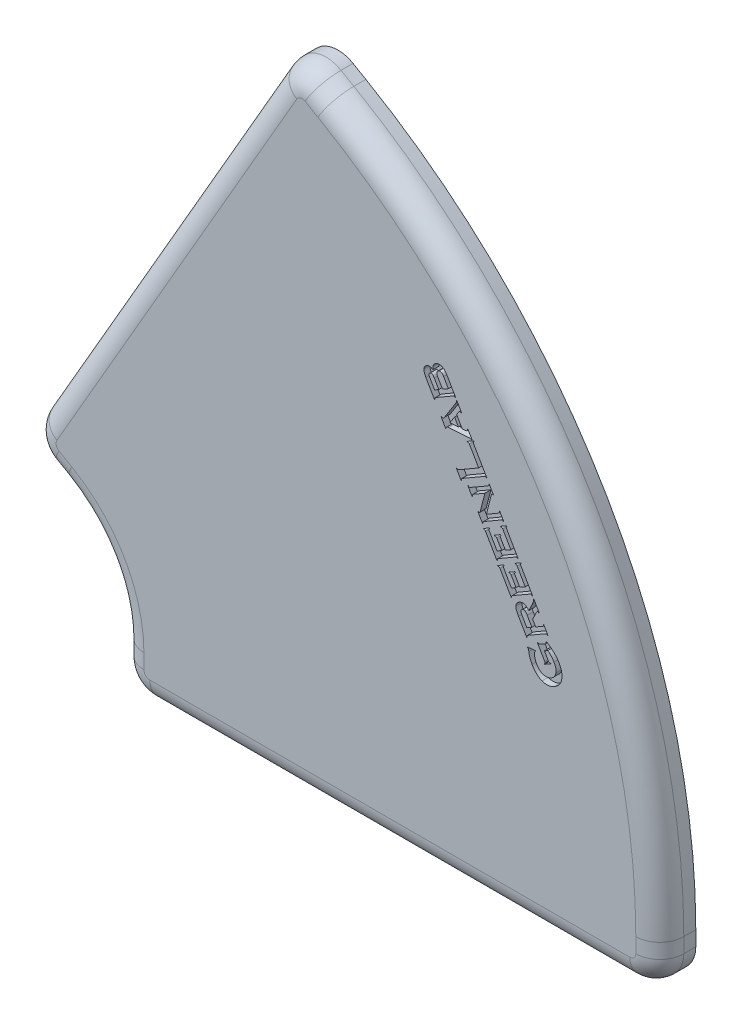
from build123d import *

# Parameters (mm, degrees)
BOSS_EXTRUDE1_DEPTH = 3
FILLET1_R           = 2.5
FILLET2_R           = 9.999999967
FILLET3_R           = 54.99999982
FILLET4_R           = 2
CUT_EXTRUDE1_DEPTH  = 0.5


with BuildPart() as part:
    # Sketch1 → Boss-Extrude1 (new body)
    with BuildSketch(Plane.XY.offset(3)):
        Polygon((22.499998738, -22.500000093), (22.499998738, 12.990320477), (-8.235571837, 30.735577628), (-30.735573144, -8.23557194), (-22.500001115, -12.990381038), (-22.500001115, -22.500000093), align=None)
    extrude(amount=-BOSS_EXTRUDE1_DEPTH)

    # Fillet1
    fillet1_edges = [part.edges().sort_by_distance(p)[0] for p in [
        (-22.500001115, -22.500000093, 1.5),
        (-30.735573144, -8.23557194, 1.5),
        (-8.235571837, 30.735577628, 1.5),
        (22.499998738, -22.500000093, 1.5),
    ]]
    fillet(fillet1_edges, radius=FILLET1_R)

    # Fillet2
    fillet2_edges = [part.edges().sort_by_distance(p)[0] for p in [
        (-22.500001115, -12.990381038, 1.5),
    ]]
    fillet(fillet2_edges, radius=FILLET2_R)

    # Fillet3
    fillet3_edges = [part.edges().sort_by_distance(p)[0] for p in [
        (22.499998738, 12.990320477, 1.5),
    ]]
    fillet(fillet3_edges, radius=FILLET3_R)

    # Fillet4
    fillet4_edges = [part.edges().sort_by_distance(p)[0] for p in [
        (-1.189e-06, -22.500000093, 3),
        (22.499998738, -19.381942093, 3),
        (-19.485573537, 11.250001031, 3),
        (-28.035255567, -9.794600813, 3),
        (-21.767768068, -21.767767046, 3),
        (21.767765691, -21.767767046, 3),
        (-29.735324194, -7.967555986, 3),
        (-7.967555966, 29.735325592, 3),
        (-22.500001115, -19.381942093, 3),
        (-23.839747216, -13.763883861, 3),
        (-5.535214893, 29.176519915, 3),
        (15.131418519, 8.73607676, 3),
    ]]
    fillet(fillet4_edges, radius=FILLET4_R)

    # Sketch2 → Cut-Extrude1 (cut)
    # profile 1 of 8: a face of its own
    with BuildSketch(Plane.XY.offset(3)):
        with BuildLine():
            add(Edge.make_bspline(
                [(3.589618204, 13.705303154), (3.587638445, 13.731512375), (3.583900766, 13.780993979), (3.583940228, 13.851126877), (3.587916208, 13.912828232), (3.595742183, 13.950404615), (3.599383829, 13.967889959)],
                knots=[0, 0, 0, 0, 1.194992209, 2.256081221, 3.188505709, 4, 4, 4, 4], degree=3))
            add(Edge.make_bspline(
                [(3.599383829, 13.967889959), (3.603108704, 13.983759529), (3.61049232, 14.015216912), (3.629176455, 14.059817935), (3.651168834, 14.102459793), (3.678578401, 14.142300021), (3.710805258, 14.179212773), (3.747630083, 14.213814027), (3.789298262, 14.24575152), (3.819833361, 14.264387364), (3.835386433, 14.273879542)],
                knots=[0, 0, 0, 0, 0.979892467, 1.942387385, 2.901921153, 3.865401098, 4.845716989, 5.84715339, 6.903446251, 8, 8, 8, 8], degree=3))
            add(Edge.make_bspline(
                [(3.835386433, 14.273879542), (3.856859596, 14.28555997), (3.898821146, 14.308385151), (3.964328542, 14.334048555), (4.02993179, 14.351049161), (4.095325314, 14.359788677), (4.16045815, 14.360627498), (4.22526618, 14.351954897), (4.290099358, 14.336029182), (4.331810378, 14.318911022), (4.352964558, 14.310229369)],
                knots=[0, 0, 0, 0, 1.084995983, 2.120233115, 3.115816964, 4.0882861, 5.044225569, 5.999726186, 6.985540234, 8, 8, 8, 8], degree=3))
            add(Edge.make_bspline(
                [(4.352964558, 14.310229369), (4.3718211, 14.301052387), (4.410092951, 14.282426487), (4.464220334, 14.246277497), (4.517714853, 14.205358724), (4.568712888, 14.156843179), (4.618794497, 14.102797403), (4.666364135, 14.041371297), (4.713147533, 13.974321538), (4.741888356, 13.926299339), (4.756610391, 13.901700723)],
                knots=[0, 0, 0, 0, 0.861570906, 1.748672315, 2.671085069, 3.628806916, 4.639478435, 5.698894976, 6.821295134, 8, 8, 8, 8], degree=3))
            Line((4.756610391, 13.901700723), (5.487947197, 12.635424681))
            Line((5.487947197, 12.635424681), (5.453224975, 12.615350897))
            add(Edge.make_bspline(
                [(5.453224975, 12.615350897), (5.445585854, 12.622731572), (5.431260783, 12.636572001), (5.409017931, 12.653904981), (5.386958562, 12.665578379), (5.365433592, 12.672537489), (5.343578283, 12.674072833), (5.321215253, 12.671392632), (5.297910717, 12.663229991), (5.282768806, 12.655344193), (5.274731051, 12.651158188)],
                knots=[0, 0, 0, 0, 1.270161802, 2.381839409, 3.358928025, 4.241437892, 5.065851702, 5.959161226, 6.916664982, 8, 8, 8, 8], degree=3))
            Line((5.274731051, 12.651158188), (3.809887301, 11.805346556))
            add(Edge.make_bspline(
                [(3.809887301, 11.805346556), (3.802365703, 11.80044521), (3.788188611, 11.791206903), (3.769578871, 11.775550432), (3.756395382, 11.757781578), (3.747075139, 11.738691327), (3.74302046, 11.716916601), (3.742029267, 11.692092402), (3.744910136, 11.663467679), (3.749434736, 11.643446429), (3.751836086, 11.632820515)],
                knots=[0, 0, 0, 0, 1.077921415, 2.03172136, 2.900158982, 3.715982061, 4.559082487, 5.537039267, 6.692828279, 8, 8, 8, 8], degree=3))
            Line((3.751836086, 11.632820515), (3.717113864, 11.61274673))
            Line((3.717113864, 11.61274673), (3.002595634, 12.850268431))
            add(Edge.make_bspline(
                [(3.002595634, 12.850268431), (2.987869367, 12.876716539), (2.959447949, 12.927760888), (2.922364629, 13.004111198), (2.891590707, 13.076893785), (2.868981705, 13.14694328), (2.851454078, 13.213109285), (2.841891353, 13.276190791), (2.837699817, 13.336068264), (2.841321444, 13.374549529), (2.843090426, 13.393345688)],
                knots=[0, 0, 0, 0, 1.262450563, 2.43650574, 3.53900008, 4.55520189, 5.504738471, 6.390241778, 7.213714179, 8, 8, 8, 8], degree=3))
            add(Edge.make_bspline(
                [(2.843090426, 13.393345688), (2.846100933, 13.412242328), (2.851994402, 13.449235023), (2.8679608, 13.502484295), (2.889856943, 13.552103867), (2.917132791, 13.598688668), (2.950369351, 13.641850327), (2.98998413, 13.680877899), (3.034663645, 13.71724658), (3.067983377, 13.737686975), (3.085060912, 13.748163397)],
                knots=[0, 0, 0, 0, 1.028227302, 2.01289216, 2.979670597, 3.938786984, 4.909519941, 5.899836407, 6.923592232, 8, 8, 8, 8], degree=3))
            add(Edge.make_bspline(
                [(3.085060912, 13.748163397), (3.105408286, 13.759062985), (3.144334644, 13.779914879), (3.205078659, 13.800740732), (3.264103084, 13.812378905), (3.323186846, 13.81225867), (3.383760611, 13.800856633), (3.448577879, 13.780026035), (3.518154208, 13.74719828), (3.564882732, 13.719804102), (3.589618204, 13.705303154)],
                knots=[0, 0, 0, 0, 1.027134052, 1.964999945, 2.850141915, 3.69630986, 4.580019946, 5.586717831, 6.722543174, 8, 8, 8, 8], degree=3))
        make_face()
        with BuildLine():
            Line((4.07627185, 12.514439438), (3.698125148, 13.168736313))
            add(Edge.make_bspline(
                [(3.698125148, 13.168736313), (3.683802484, 13.192266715), (3.657312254, 13.235786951), (3.616096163, 13.293056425), (3.575360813, 13.335680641), (3.535370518, 13.365597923), (3.493584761, 13.381079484), (3.45005292, 13.38478442), (3.404640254, 13.373701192), (3.375943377, 13.359258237), (3.360668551, 13.351570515)],
                knots=[0, 0, 0, 0, 1.504565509, 2.782742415, 3.844473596, 4.71599428, 5.484793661, 6.247669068, 7.067266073, 8, 8, 8, 8], degree=3))
            add(Edge.make_bspline(
                [(3.360668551, 13.351570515), (3.346493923, 13.342374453), (3.319729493, 13.325010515), (3.287885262, 13.291305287), (3.268605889, 13.25234453), (3.261441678, 13.208672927), (3.266973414, 13.159372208), (3.284589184, 13.103108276), (3.312556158, 13.037930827), (3.337435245, 12.992911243), (3.350902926, 12.968541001)],
                knots=[0, 0, 0, 0, 0.921957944, 1.740834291, 2.501514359, 3.26399212, 4.127962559, 5.188851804, 6.478254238, 8, 8, 8, 8], degree=3))
            Line((3.350902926, 12.968541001), (3.729049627, 12.314244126))
            Line((3.729049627, 12.314244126), (4.07627185, 12.514439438))
        make_face(mode=Mode.SUBTRACT)
        with BuildLine():
            Line((4.874882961, 12.975593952), (4.483172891, 13.653762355))
            add(Edge.make_bspline(
                [(4.483172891, 13.653762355), (4.467687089, 13.679133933), (4.43860537, 13.726780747), (4.388465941, 13.787824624), (4.336708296, 13.834691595), (4.282465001, 13.867089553), (4.225719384, 13.884089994), (4.167100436, 13.885518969), (4.107078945, 13.872124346), (4.069749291, 13.852713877), (4.050230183, 13.842564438)],
                knots=[0, 0, 0, 0, 1.32586928, 2.489929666, 3.513828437, 4.429211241, 5.287664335, 6.127732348, 7.021019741, 8, 8, 8, 8], degree=3))
            add(Edge.make_bspline(
                [(4.050230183, 13.842564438), (4.031489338, 13.830730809), (3.995904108, 13.808261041), (3.95454941, 13.762677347), (3.926005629, 13.711558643), (3.913332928, 13.653719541), (3.91375172, 13.590679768), (3.928315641, 13.522318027), (3.956122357, 13.44831521), (3.982832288, 13.399355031), (3.99706178, 13.373271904)],
                knots=[0, 0, 0, 0, 0.985570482, 1.871407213, 2.716839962, 3.570750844, 4.483125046, 5.512375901, 6.674739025, 8, 8, 8, 8], degree=3))
            Line((3.99706178, 13.373271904), (4.38877185, 12.695103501))
            Line((4.38877185, 12.695103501), (4.874882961, 12.975593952))
        make_face(mode=Mode.SUBTRACT)
    # profile 2 of 8: a face of its own
    with BuildSketch(Plane.XY.offset(3)):
        with BuildLine():
            Line((5.567157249, 11.455454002), (6.028854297, 10.655757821))
            Line((6.028854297, 10.655757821), (6.286015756, 10.676916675))
            add(Edge.make_bspline(
                [(6.286015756, 10.676916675), (6.300343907, 10.678467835), (6.326987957, 10.681352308), (6.363393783, 10.689064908), (6.393817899, 10.697782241), (6.411065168, 10.706179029), (6.418936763, 10.710011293)],
                knots=[0, 0, 0, 0, 1.254135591, 2.332139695, 3.238794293, 4, 4, 4, 4], degree=3))
            add(Edge.make_bspline(
                [(6.418936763, 10.710011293), (6.425034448, 10.713989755), (6.4368143, 10.721675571), (6.451932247, 10.73589384), (6.462935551, 10.75270111), (6.470708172, 10.771262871), (6.474312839, 10.7919527), (6.474910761, 10.814286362), (6.47132581, 10.838526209), (6.466862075, 10.854912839), (6.464509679, 10.86354862)],
                knots=[0, 0, 0, 0, 0.996004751, 1.924137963, 2.816916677, 3.727375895, 4.659793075, 5.675305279, 6.774882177, 8, 8, 8, 8], degree=3))
            Line((6.464509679, 10.86354862), (6.499231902, 10.883622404))
            Line((6.499231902, 10.883622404), (6.870325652, 10.241261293))
            Line((6.870325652, 10.241261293), (6.835603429, 10.221187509))
            add(Edge.make_bspline(
                [(6.835603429, 10.221187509), (6.82840569, 10.229716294), (6.814834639, 10.24579698), (6.792238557, 10.265487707), (6.770065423, 10.280733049), (6.746147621, 10.290415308), (6.718900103, 10.296564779), (6.685747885, 10.299324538), (6.645326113, 10.299758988), (6.616052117, 10.298063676), (6.60014336, 10.29714237)],
                knots=[0, 0, 0, 0, 1.0241798, 1.931050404, 2.747002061, 3.484717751, 4.287012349, 5.305783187, 6.535845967, 8, 8, 8, 8], degree=3))
            Line((6.60014336, 10.29714237), (4.90092461, 10.181039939))
            add(Edge.make_bspline(
                [(4.90092461, 10.181039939), (4.885680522, 10.179769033), (4.856598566, 10.177344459), (4.816016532, 10.168346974), (4.779871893, 10.157409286), (4.758656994, 10.146616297), (4.748472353, 10.141434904)],
                knots=[0, 0, 0, 0, 1.155103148, 2.203651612, 3.137626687, 4, 4, 4, 4], degree=3))
            add(Edge.make_bspline(
                [(4.748472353, 10.141434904), (4.738508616, 10.134332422), (4.718519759, 10.120083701), (4.701079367, 10.084741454), (4.692968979, 10.042120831), (4.695883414, 10.01125456), (4.697474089, 9.994407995)],
                knots=[0, 0, 0, 0, 0.876646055, 1.75869295, 2.776712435, 4, 4, 4, 4], degree=3))
            Line((4.697474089, 9.994407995), (4.662751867, 9.97433421))
            Line((4.662751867, 9.97433421), (4.263988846, 10.664980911))
            Line((4.263988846, 10.664980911), (4.298711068, 10.685054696))
            add(Edge.make_bspline(
                [(4.298711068, 10.685054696), (4.312398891, 10.675456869), (4.337646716, 10.65775323), (4.379674, 10.643247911), (4.421279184, 10.64394328), (4.44544781, 10.655031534), (4.457673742, 10.660640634)],
                knots=[0, 0, 0, 0, 1.167210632, 2.152974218, 3.065664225, 4, 4, 4, 4], degree=3))
            add(Edge.make_bspline(
                [(4.457673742, 10.660640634), (4.466724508, 10.666729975), (4.485877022, 10.679615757), (4.512565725, 10.705508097), (4.53966993, 10.737343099), (4.555962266, 10.762074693), (4.564553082, 10.77511546)],
                knots=[0, 0, 0, 0, 0.827633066, 1.751371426, 2.814316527, 4, 4, 4, 4], degree=3))
            Line((4.564553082, 10.77511546), (5.459735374, 12.190046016))
            add(Edge.make_bspline(
                [(5.459735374, 12.190046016), (5.470725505, 12.208047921), (5.490741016, 12.240833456), (5.51603996, 12.286475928), (5.533780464, 12.323706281), (5.544862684, 12.354718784), (5.549846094, 12.383209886), (5.547986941, 12.412697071), (5.542769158, 12.444838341), (5.535647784, 12.466636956), (5.531892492, 12.478131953)],
                knots=[0, 0, 0, 0, 1.626172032, 2.96162641, 4.022219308, 4.802727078, 5.495044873, 6.234619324, 7.069067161, 8, 8, 8, 8], degree=3))
            Line((5.531892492, 12.478131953), (5.566614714, 12.498205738))
            Line((5.566614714, 12.498205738), (5.997929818, 11.75167796))
            Line((5.997929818, 11.75167796), (5.963207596, 11.731604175))
            add(Edge.make_bspline(
                [(5.963207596, 11.731604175), (5.956638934, 11.738944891), (5.944263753, 11.752774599), (5.924777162, 11.770851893), (5.904248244, 11.783240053), (5.884044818, 11.792566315), (5.863144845, 11.796504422), (5.842352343, 11.79496065), (5.821273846, 11.79042835), (5.808272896, 11.7834881), (5.801532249, 11.779889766)],
                knots=[0, 0, 0, 0, 1.269668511, 2.392020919, 3.407178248, 4.346494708, 5.246852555, 6.110269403, 7.02022494, 8, 8, 8, 8], degree=3))
            add(Edge.make_bspline(
                [(5.801532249, 11.779889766), (5.792827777, 11.774181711), (5.774046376, 11.761865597), (5.74845116, 11.736232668), (5.722143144, 11.704431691), (5.705990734, 11.68005783), (5.697365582, 11.667042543)],
                knots=[0, 0, 0, 0, 0.804698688, 1.736276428, 2.791204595, 4, 4, 4, 4], degree=3))
            Line((5.697365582, 11.667042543), (5.567157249, 11.455454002))
        make_face()
        Polygon((5.395173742, 11.191782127), (4.995325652, 10.578717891), (5.717981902, 10.632971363), align=None, mode=Mode.SUBTRACT)
    # profile 3 of 8: a face of its own
    with BuildSketch(Plane.XY.offset(3)):
        with BuildLine():
            Line((7.401467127, 8.519067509), (6.626727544, 9.860755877))
            add(Edge.make_bspline(
                [(6.626727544, 9.860755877), (6.621826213, 9.868277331), (6.612587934, 9.882454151), (6.596931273, 9.901065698), (6.57916305, 9.9142432), (6.560070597, 9.923584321), (6.538304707, 9.927555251), (6.513578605, 9.928926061), (6.485244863, 9.924280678), (6.465377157, 9.919655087), (6.454744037, 9.917179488)],
                knots=[0, 0, 0, 0, 1.079559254, 2.034808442, 2.904565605, 3.721628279, 4.566009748, 5.545452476, 6.686335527, 8, 8, 8, 8], degree=3))
            Line((6.454744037, 9.917179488), (6.434670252, 9.951901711))
            Line((6.434670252, 9.951901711), (6.990225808, 10.273082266))
            Line((6.990225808, 10.273082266), (7.010299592, 10.238360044))
            add(Edge.make_bspline(
                [(7.010299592, 10.238360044), (7.002913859, 10.230352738), (6.989124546, 10.215402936), (6.971969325, 10.19245979), (6.959686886, 10.170894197), (6.952527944, 10.149875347), (6.951014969, 10.128882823), (6.953864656, 10.107097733), (6.961868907, 10.084129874), (6.969760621, 10.068988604), (6.973949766, 10.06095119)],
                knots=[0, 0, 0, 0, 1.309722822, 2.445279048, 3.438336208, 4.284481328, 5.091995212, 5.947318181, 6.910378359, 8, 8, 8, 8], degree=3))
            Line((6.973949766, 10.06095119), (8.089401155, 8.129527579))
            Line((8.089401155, 8.129527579), (8.054678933, 8.109453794))
            add(Edge.make_bspline(
                [(8.054678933, 8.109453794), (8.046688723, 8.117031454), (8.031846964, 8.131106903), (8.008934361, 8.148444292), (7.987066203, 8.159976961), (7.96621301, 8.167243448), (7.945184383, 8.168769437), (7.923527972, 8.165735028), (7.900462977, 8.158704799), (7.885639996, 8.150616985), (7.877812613, 8.146346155)],
                knots=[0, 0, 0, 0, 1.327910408, 2.466584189, 3.452040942, 4.300509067, 5.110239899, 5.96791107, 6.926940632, 8, 8, 8, 8], degree=3))
            Line((7.877812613, 8.146346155), (6.02776921, 7.077552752))
            add(Edge.make_bspline(
                [(6.02776921, 7.077552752), (6.020227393, 7.072863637), (6.005936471, 7.063978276), (5.987459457, 7.048288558), (5.974422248, 7.030633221), (5.964914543, 7.011860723), (5.960596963, 6.990208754), (5.961492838, 6.965374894), (5.963614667, 6.936697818), (5.968662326, 6.916727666), (5.971345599, 6.90611178)],
                knots=[0, 0, 0, 0, 1.069591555, 2.026759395, 2.898263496, 3.697307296, 4.543384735, 5.523826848, 6.683696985, 8, 8, 8, 8], degree=3))
            Line((5.971345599, 6.90611178), (5.936623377, 6.886037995))
            Line((5.936623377, 6.886037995), (5.535690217, 7.58048244))
            Line((5.535690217, 7.58048244), (5.570412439, 7.600556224))
            add(Edge.make_bspline(
                [(5.570412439, 7.600556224), (5.578216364, 7.592970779), (5.59268997, 7.578902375), (5.61531589, 7.561560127), (5.636803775, 7.549397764), (5.657974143, 7.542227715), (5.679409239, 7.54053598), (5.701339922, 7.54440562), (5.724636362, 7.551249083), (5.739454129, 7.559373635), (5.747278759, 7.563663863)],
                knots=[0, 0, 0, 0, 1.308080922, 2.426042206, 3.418950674, 4.264969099, 5.094042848, 5.973778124, 6.930038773, 8, 8, 8, 8], degree=3))
            Line((5.747278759, 7.563663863), (7.401467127, 8.519067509))
        make_face()
    # profile 4 of 8: a face of its own
    with BuildSketch(Plane.XY.offset(3)):
        with BuildLine():
            Line((8.047625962, 5.499292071), (9.063250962, 6.085772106))
            add(Edge.make_bspline(
                [(9.063250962, 6.085772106), (9.070772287, 6.090673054), (9.085162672, 6.10004993), (9.103947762, 6.115914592), (9.117369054, 6.134109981), (9.1272172, 6.153624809), (9.131803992, 6.175967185), (9.132719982, 6.201020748), (9.129858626, 6.229281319), (9.125333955, 6.248938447), (9.122929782, 6.259383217)],
                knots=[0, 0, 0, 0, 1.069398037, 2.046055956, 2.907626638, 3.745722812, 4.628832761, 5.599056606, 6.724264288, 8, 8, 8, 8], degree=3))
            Line((9.122929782, 6.259383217), (9.157652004, 6.279457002))
            Line((9.157652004, 6.279457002), (9.49836381, 5.689179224))
            Line((9.49836381, 5.689179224), (9.463641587, 5.669105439))
            add(Edge.make_bspline(
                [(9.463641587, 5.669105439), (9.456002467, 5.676486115), (9.441677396, 5.690326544), (9.419434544, 5.707659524), (9.397375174, 5.719332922), (9.375850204, 5.726292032), (9.353994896, 5.727827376), (9.331631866, 5.725147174), (9.30832733, 5.716984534), (9.293185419, 5.709098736), (9.285147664, 5.704912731)],
                knots=[0, 0, 0, 0, 1.270161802, 2.381839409, 3.358928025, 4.241437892, 5.065851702, 5.959161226, 6.916664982, 8, 8, 8, 8], degree=3))
            Line((9.285147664, 5.704912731), (7.820303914, 4.859101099))
            add(Edge.make_bspline(
                [(7.820303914, 4.859101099), (7.812782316, 4.854199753), (7.798605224, 4.844961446), (7.779995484, 4.829304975), (7.766811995, 4.811536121), (7.757491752, 4.79244587), (7.753437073, 4.770671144), (7.75244588, 4.745846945), (7.755326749, 4.717222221), (7.759851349, 4.697200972), (7.762252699, 4.686575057)],
                knots=[0, 0, 0, 0, 1.077921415, 2.03172136, 2.900158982, 3.715982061, 4.559082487, 5.537039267, 6.692828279, 8, 8, 8, 8], degree=3))
            Line((7.762252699, 4.686575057), (7.727530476, 4.666501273))
            Line((7.727530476, 4.666501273), (7.333650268, 5.349009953))
            Line((7.333650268, 5.349009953), (7.36837249, 5.369083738))
            add(Edge.make_bspline(
                [(7.36837249, 5.369083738), (7.377381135, 5.360248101), (7.393412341, 5.344524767), (7.420628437, 5.329650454), (7.44776587, 5.324845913), (7.463262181, 5.331579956), (7.470911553, 5.33490405)],
                knots=[0, 0, 0, 0, 1.290703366, 2.296853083, 3.159283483, 4, 4, 4, 4], degree=3))
            add(Edge.make_bspline(
                [(7.470911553, 5.33490405), (7.477406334, 5.339442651), (7.491413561, 5.349231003), (7.506466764, 5.373161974), (7.520911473, 5.402639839), (7.527532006, 5.425533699), (7.531132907, 5.437985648)],
                knots=[0, 0, 0, 0, 0.771714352, 1.664348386, 2.729641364, 4, 4, 4, 4], degree=3))
            Line((7.531132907, 5.437985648), (7.925013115, 6.956540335))
            Line((7.925013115, 6.956540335), (6.938142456, 6.386878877))
            add(Edge.make_bspline(
                [(6.938142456, 6.386878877), (6.930609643, 6.381986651), (6.916411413, 6.372765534), (6.897858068, 6.356923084), (6.884115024, 6.339360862), (6.874327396, 6.320277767), (6.869306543, 6.298355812), (6.869335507, 6.273385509), (6.872680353, 6.244810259), (6.877505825, 6.22497843), (6.88009124, 6.214352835)],
                knots=[0, 0, 0, 0, 1.073417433, 2.023232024, 2.901183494, 3.723036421, 4.567333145, 5.562098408, 6.693809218, 8, 8, 8, 8], degree=3))
            Line((6.88009124, 6.214352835), (6.845369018, 6.19427905))
            Line((6.845369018, 6.19427905), (6.504114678, 6.784556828))
            Line((6.504114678, 6.784556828), (6.5388369, 6.804630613))
            add(Edge.make_bspline(
                [(6.5388369, 6.804630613), (6.546826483, 6.797050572), (6.561667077, 6.782970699), (6.584587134, 6.765661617), (6.606585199, 6.753961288), (6.627862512, 6.746887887), (6.649447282, 6.745179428), (6.671497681, 6.748879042), (6.6945769, 6.756575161), (6.709484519, 6.764599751), (6.717330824, 6.768823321)],
                knots=[0, 0, 0, 0, 1.315771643, 2.444036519, 3.420484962, 4.281782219, 5.105655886, 5.979873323, 6.936749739, 8, 8, 8, 8], degree=3))
            Line((6.717330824, 6.768823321), (8.180546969, 7.613549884))
            add(Edge.make_bspline(
                [(8.180546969, 7.613549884), (8.188031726, 7.618491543), (8.202253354, 7.627881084), (8.221423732, 7.643133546), (8.234481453, 7.661272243), (8.244539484, 7.680272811), (8.249168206, 7.702475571), (8.250018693, 7.727535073), (8.247068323, 7.75631615), (8.242623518, 7.776352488), (8.240225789, 7.787160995)],
                knots=[0, 0, 0, 0, 1.0681569, 2.029582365, 2.890153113, 3.707978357, 4.569086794, 5.559678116, 6.683579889, 8, 8, 8, 8], degree=3))
            Line((8.240225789, 7.787160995), (8.274948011, 7.80723478))
            Line((8.274948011, 7.80723478), (8.642786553, 7.170299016))
            Line((8.642786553, 7.170299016), (8.608064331, 7.150225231))
            add(Edge.make_bspline(
                [(8.608064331, 7.150225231), (8.599574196, 7.159128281), (8.584414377, 7.175025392), (8.558696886, 7.191572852), (8.531978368, 7.195895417), (8.516793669, 7.189648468), (8.509323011, 7.186575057)],
                knots=[0, 0, 0, 0, 1.289593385, 2.30267275, 3.164938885, 4, 4, 4, 4], degree=3))
            add(Edge.make_bspline(
                [(8.509323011, 7.186575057), (8.502113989, 7.181046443), (8.48631733, 7.168931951), (8.474798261, 7.143455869), (8.465381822, 7.116389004), (8.455462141, 7.085854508), (8.444566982, 7.04565364), (8.435950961, 7.015844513), (8.431198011, 6.999400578)],
                knots=[0, 0, 0, 0, 0.781868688, 1.713257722, 2.366731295, 3.294374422, 4.507466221, 6, 6, 6, 6], degree=3))
            Line((8.431198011, 6.999400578), (8.047625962, 5.499292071))
        make_face()
    # profile 5 of 8: a face of its own
    with BuildSketch(Plane.XY.offset(3)):
        with BuildLine():
            Line((9.631827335, 3.694079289), (10.083216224, 3.954495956))
            Line((10.083216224, 3.954495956), (9.411015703, 5.118232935))
            add(Edge.make_bspline(
                [(9.411015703, 5.118232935), (9.406156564, 5.12597128), (9.396932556, 5.140660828), (9.380484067, 5.159569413), (9.362658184, 5.173780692), (9.343326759, 5.183701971), (9.321394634, 5.188569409), (9.296485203, 5.189282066), (9.267648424, 5.186502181), (9.247660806, 5.181629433), (9.236862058, 5.178996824)],
                knots=[0, 0, 0, 0, 1.078086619, 2.04651052, 2.943787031, 3.755659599, 4.589703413, 5.573084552, 6.68880582, 8, 8, 8, 8], degree=3))
            Line((9.236862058, 5.178996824), (9.216788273, 5.213719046))
            Line((9.216788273, 5.213719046), (9.737621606, 5.514825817))
            Line((9.737621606, 5.514825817), (9.757695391, 5.480103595))
            add(Edge.make_bspline(
                [(9.757695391, 5.480103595), (9.750210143, 5.472536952), (9.736146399, 5.458320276), (9.72002887, 5.435082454), (9.707301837, 5.413476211), (9.70055647, 5.391580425), (9.698747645, 5.369679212), (9.702560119, 5.347281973), (9.710156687, 5.323830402), (9.718202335, 5.308553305), (9.722430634, 5.300524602)],
                knots=[0, 0, 0, 0, 1.264087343, 2.375045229, 3.357651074, 4.2359404, 5.07787082, 5.948477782, 6.921845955, 8, 8, 8, 8], degree=3))
            Line((9.722430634, 5.300524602), (10.69628046, 3.614326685))
            Line((10.69628046, 3.614326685), (10.661558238, 3.5942529))
            add(Edge.make_bspline(
                [(10.661558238, 3.5942529), (10.653919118, 3.601633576), (10.639594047, 3.615474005), (10.617351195, 3.632806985), (10.595291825, 3.644480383), (10.573766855, 3.651439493), (10.551911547, 3.652974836), (10.529548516, 3.650294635), (10.50624398, 3.642131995), (10.49110207, 3.634246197), (10.483064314, 3.630060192)],
                knots=[0, 0, 0, 0, 1.270161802, 2.381839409, 3.358928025, 4.241437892, 5.065851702, 5.959161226, 6.916664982, 8, 8, 8, 8], degree=3))
            Line((10.483064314, 3.630060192), (9.018220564, 2.78424856))
            add(Edge.make_bspline(
                [(9.018220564, 2.78424856), (9.010698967, 2.779347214), (8.996521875, 2.770108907), (8.977912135, 2.754452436), (8.964728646, 2.736683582), (8.955408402, 2.717593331), (8.951353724, 2.695818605), (8.95036253, 2.670994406), (8.953243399, 2.642369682), (8.957768, 2.622348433), (8.960169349, 2.611722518)],
                knots=[0, 0, 0, 0, 1.077921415, 2.03172136, 2.900158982, 3.715982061, 4.559082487, 5.537039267, 6.692828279, 8, 8, 8, 8], degree=3))
            Line((8.960169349, 2.611722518), (8.925447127, 2.591648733))
            Line((8.925447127, 2.591648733), (7.973298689, 4.240411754))
            add(Edge.make_bspline(
                [(7.973298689, 4.240411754), (7.968546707, 4.248598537), (7.959602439, 4.264007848), (7.942197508, 4.282424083), (7.924826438, 4.297395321), (7.905000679, 4.306923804), (7.882960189, 4.311732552), (7.857825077, 4.312716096), (7.829294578, 4.308992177), (7.809237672, 4.304593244), (7.798602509, 4.302260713)],
                knots=[0, 0, 0, 0, 1.106938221, 2.083499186, 2.958610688, 3.784462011, 4.63397532, 5.590023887, 6.722111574, 8, 8, 8, 8], degree=3))
            Line((7.798602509, 4.302260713), (7.778528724, 4.336982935))
            Line((7.778528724, 4.336982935), (8.299362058, 4.637547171))
            Line((8.299362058, 4.637547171), (8.319435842, 4.602824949))
            add(Edge.make_bspline(
                [(8.319435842, 4.602824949), (8.311773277, 4.594705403), (8.297590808, 4.579677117), (8.281209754, 4.555633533), (8.268615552, 4.53384292), (8.262256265, 4.512087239), (8.261075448, 4.490345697), (8.265524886, 4.467666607), (8.273441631, 4.443162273), (8.282246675, 4.427273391), (8.286883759, 4.418905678)],
                knots=[0, 0, 0, 0, 1.297281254, 2.401108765, 3.380695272, 4.213553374, 5.01467439, 5.89033718, 6.888968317, 8, 8, 8, 8], degree=3))
            Line((8.286883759, 4.418905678), (8.937382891, 3.293146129))
            Line((8.937382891, 3.293146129), (9.319327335, 3.513415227))
            Line((9.319327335, 3.513415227), (8.910798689, 4.220880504))
            add(Edge.make_bspline(
                [(8.910798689, 4.220880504), (8.905783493, 4.228996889), (8.896318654, 4.24431439), (8.879370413, 4.263682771), (8.861129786, 4.278147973), (8.841520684, 4.288509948), (8.819235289, 4.293917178), (8.793951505, 4.295246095), (8.764977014, 4.292927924), (8.744744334, 4.288756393), (8.73393237, 4.286527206)],
                knots=[0, 0, 0, 0, 1.105542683, 2.086415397, 2.967788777, 3.793471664, 4.638126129, 5.605216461, 6.720272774, 8, 8, 8, 8], degree=3))
            Line((8.73393237, 4.286527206), (8.713858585, 4.321249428))
            Line((8.713858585, 4.321249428), (9.234691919, 4.622356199))
            Line((9.234691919, 4.622356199), (9.254765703, 4.587633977))
            add(Edge.make_bspline(
                [(9.254765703, 4.587633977), (9.247287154, 4.579696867), (9.233193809, 4.564739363), (9.217044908, 4.540699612), (9.205172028, 4.51826921), (9.197950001, 4.49644923), (9.197006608, 4.474059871), (9.201302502, 4.451022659), (9.209365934, 4.426090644), (9.218454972, 4.410078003), (9.223298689, 4.401544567)],
                knots=[0, 0, 0, 0, 1.255913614, 2.366772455, 3.327673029, 4.178836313, 4.993429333, 5.88161685, 6.871074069, 8, 8, 8, 8], degree=3))
            Line((9.223298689, 4.401544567), (9.631827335, 3.694079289))
        make_face()
    # profile 6 of 8: a face of its own
    with BuildSketch(Plane.XY.offset(3)):
        with BuildLine():
            Line((10.829743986, 1.61922675), (11.281132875, 1.879643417))
            Line((11.281132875, 1.879643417), (10.608932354, 3.043380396))
            add(Edge.make_bspline(
                [(10.608932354, 3.043380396), (10.604073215, 3.051118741), (10.594849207, 3.065808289), (10.578400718, 3.084716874), (10.560574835, 3.098928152), (10.54124341, 3.108849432), (10.519311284, 3.11371687), (10.494401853, 3.114429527), (10.465565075, 3.111649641), (10.445577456, 3.106776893), (10.434778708, 3.104144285)],
                knots=[0, 0, 0, 0, 1.078086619, 2.04651052, 2.943787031, 3.755659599, 4.589703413, 5.573084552, 6.68880582, 8, 8, 8, 8], degree=3))
            Line((10.434778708, 3.104144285), (10.414704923, 3.138866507))
            Line((10.414704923, 3.138866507), (10.935538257, 3.439973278))
            Line((10.935538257, 3.439973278), (10.955612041, 3.405251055))
            add(Edge.make_bspline(
                [(10.955612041, 3.405251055), (10.948126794, 3.397684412), (10.93406305, 3.383467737), (10.917945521, 3.360229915), (10.905218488, 3.338623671), (10.89847312, 3.316727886), (10.896664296, 3.294826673), (10.900476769, 3.272429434), (10.908073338, 3.248977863), (10.916118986, 3.233700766), (10.920347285, 3.225672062)],
                knots=[0, 0, 0, 0, 1.264087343, 2.375045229, 3.357651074, 4.2359404, 5.07787082, 5.948477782, 6.921845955, 8, 8, 8, 8], degree=3))
            Line((10.920347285, 3.225672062), (11.894197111, 1.539474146))
            Line((11.894197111, 1.539474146), (11.859474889, 1.519400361))
            add(Edge.make_bspline(
                [(11.859474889, 1.519400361), (11.851835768, 1.526781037), (11.837510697, 1.540621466), (11.815267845, 1.557954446), (11.793208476, 1.569627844), (11.771683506, 1.576586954), (11.749828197, 1.578122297), (11.727465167, 1.575442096), (11.704160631, 1.567279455), (11.68901872, 1.559393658), (11.680980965, 1.555207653)],
                knots=[0, 0, 0, 0, 1.270161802, 2.381839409, 3.358928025, 4.241437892, 5.065851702, 5.959161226, 6.916664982, 8, 8, 8, 8], degree=3))
            Line((11.680980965, 1.555207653), (10.216137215, 0.709396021))
            add(Edge.make_bspline(
                [(10.216137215, 0.709396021), (10.208615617, 0.704494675), (10.194438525, 0.695256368), (10.175828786, 0.679599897), (10.162645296, 0.661831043), (10.153325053, 0.642740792), (10.149270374, 0.620966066), (10.148279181, 0.596141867), (10.15116005, 0.567517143), (10.15568465, 0.547495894), (10.158086, 0.536869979)],
                knots=[0, 0, 0, 0, 1.077921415, 2.03172136, 2.900158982, 3.715982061, 4.559082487, 5.537039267, 6.692828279, 8, 8, 8, 8], degree=3))
            Line((10.158086, 0.536869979), (10.123363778, 0.516796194))
            Line((10.123363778, 0.516796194), (9.17121534, 2.165559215))
            add(Edge.make_bspline(
                [(9.17121534, 2.165559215), (9.166463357, 2.173745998), (9.15751909, 2.189155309), (9.140114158, 2.207571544), (9.122743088, 2.222542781), (9.10291733, 2.232071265), (9.080876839, 2.236880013), (9.055741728, 2.237863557), (9.027211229, 2.234139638), (9.007154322, 2.229740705), (8.99651916, 2.227408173)],
                knots=[0, 0, 0, 0, 1.106938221, 2.083499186, 2.958610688, 3.784462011, 4.63397532, 5.590023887, 6.722111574, 8, 8, 8, 8], degree=3))
            Line((8.99651916, 2.227408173), (8.976445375, 2.262130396))
            Line((8.976445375, 2.262130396), (9.497278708, 2.562694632))
            Line((9.497278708, 2.562694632), (9.517352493, 2.52797241))
            add(Edge.make_bspline(
                [(9.517352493, 2.52797241), (9.509689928, 2.519852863), (9.495507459, 2.504824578), (9.479126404, 2.480780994), (9.466532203, 2.458990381), (9.460172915, 2.4372347), (9.458992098, 2.415493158), (9.463441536, 2.392814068), (9.471358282, 2.368309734), (9.480163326, 2.352420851), (9.48480041, 2.344053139)],
                knots=[0, 0, 0, 0, 1.297281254, 2.401108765, 3.380695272, 4.213553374, 5.01467439, 5.89033718, 6.888968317, 8, 8, 8, 8], degree=3))
            Line((9.48480041, 2.344053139), (10.135299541, 1.21829359))
            Line((10.135299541, 1.21829359), (10.517243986, 1.438562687))
            Line((10.517243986, 1.438562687), (10.10871534, 2.146027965))
            add(Edge.make_bspline(
                [(10.10871534, 2.146027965), (10.103700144, 2.15414435), (10.094235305, 2.16946185), (10.077287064, 2.188830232), (10.059046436, 2.203295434), (10.039437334, 2.213657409), (10.01715194, 2.219064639), (9.991868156, 2.220393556), (9.962893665, 2.218075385), (9.942660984, 2.213903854), (9.931849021, 2.211674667)],
                knots=[0, 0, 0, 0, 1.105542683, 2.086415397, 2.967788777, 3.793471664, 4.638126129, 5.605216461, 6.720272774, 8, 8, 8, 8], degree=3))
            Line((9.931849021, 2.211674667), (9.911775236, 2.246396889))
            Line((9.911775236, 2.246396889), (10.432608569, 2.54750366))
            Line((10.432608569, 2.54750366), (10.452682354, 2.512781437))
            add(Edge.make_bspline(
                [(10.452682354, 2.512781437), (10.445203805, 2.504844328), (10.43111046, 2.489886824), (10.414961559, 2.465847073), (10.403088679, 2.443416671), (10.395866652, 2.421596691), (10.394923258, 2.399207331), (10.399219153, 2.37617012), (10.407282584, 2.351238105), (10.416371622, 2.335225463), (10.42121534, 2.326692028)],
                knots=[0, 0, 0, 0, 1.255913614, 2.366772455, 3.327673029, 4.178836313, 4.993429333, 5.88161685, 6.871074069, 8, 8, 8, 8], degree=3))
            Line((10.42121534, 2.326692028), (10.829743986, 1.61922675))
        make_face()
    # profile 7 of 8: a face of its own
    with BuildSketch(Plane.XY.offset(3)):
        with BuildLine():
            Line((12.149188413, -0.585903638), (12.723190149, -0.254414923))
            add(Edge.make_bspline(
                [(12.723190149, -0.254414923), (12.730927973, -0.249553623), (12.745400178, -0.240461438), (12.763961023, -0.224421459), (12.777872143, -0.207046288), (12.78700109, -0.187505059), (12.791836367, -0.16570268), (12.792651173, -0.140597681), (12.789648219, -0.111883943), (12.785582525, -0.091622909), (12.783411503, -0.080803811)],
                knots=[0, 0, 0, 0, 1.085838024, 2.030864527, 2.904390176, 3.71270898, 4.573695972, 5.542657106, 6.687814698, 8, 8, 8, 8], degree=3))
            Line((12.783411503, -0.080803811), (12.818133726, -0.060730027))
            Line((12.818133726, -0.060730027), (13.178919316, -0.685730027))
            Line((13.178919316, -0.685730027), (13.144197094, -0.705803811))
            add(Edge.make_bspline(
                [(13.144197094, -0.705803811), (13.136557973, -0.698423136), (13.122232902, -0.684582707), (13.09999005, -0.667249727), (13.077930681, -0.655576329), (13.056405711, -0.648617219), (13.034550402, -0.647081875), (13.012187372, -0.649762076), (12.988882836, -0.657924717), (12.973740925, -0.665810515), (12.96570317, -0.66999652)],
                knots=[0, 0, 0, 0, 1.270161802, 2.381839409, 3.358928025, 4.241437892, 5.065851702, 5.959161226, 6.916664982, 8, 8, 8, 8], degree=3))
            Line((12.96570317, -0.66999652), (11.50085942, -1.515808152))
            add(Edge.make_bspline(
                [(11.50085942, -1.515808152), (11.493337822, -1.520709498), (11.47916073, -1.529947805), (11.460550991, -1.545604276), (11.447367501, -1.56337313), (11.438047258, -1.582463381), (11.433992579, -1.604238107), (11.433001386, -1.629062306), (11.435882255, -1.65768703), (11.440406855, -1.677708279), (11.442808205, -1.688334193)],
                knots=[0, 0, 0, 0, 1.077921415, 2.03172136, 2.900158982, 3.715982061, 4.559082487, 5.537039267, 6.692828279, 8, 8, 8, 8], degree=3))
            Line((11.442808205, -1.688334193), (11.408085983, -1.708407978))
            Line((11.408085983, -1.708407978), (10.725577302, -0.526224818))
            add(Edge.make_bspline(
                [(10.725577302, -0.526224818), (10.704827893, -0.490044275), (10.66584693, -0.422073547), (10.615977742, -0.32450428), (10.574588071, -0.239938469), (10.545152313, -0.164696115), (10.523220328, -0.095967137), (10.510098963, -0.029516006), (10.50170581, 0.036163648), (10.501937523, 0.079761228), (10.502052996, 0.101487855)],
                knots=[0, 0, 0, 0, 1.481694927, 2.783592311, 3.893076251, 4.825012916, 5.652242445, 6.452477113, 7.228800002, 8, 8, 8, 8], degree=3))
            add(Edge.make_bspline(
                [(10.502052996, 0.101487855), (10.50358194, 0.123099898), (10.50661151, 0.165923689), (10.522342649, 0.227982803), (10.545746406, 0.286925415), (10.578271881, 0.34208426), (10.619029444, 0.393957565), (10.667515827, 0.443085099), (10.725073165, 0.488400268), (10.767956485, 0.514446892), (10.790138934, 0.527920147)],
                knots=[0, 0, 0, 0, 0.963050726, 1.908264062, 2.836799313, 3.778645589, 4.748271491, 5.767449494, 6.845158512, 8, 8, 8, 8], degree=3))
            add(Edge.make_bspline(
                [(10.790138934, 0.527920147), (10.807540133, 0.537420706), (10.841370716, 0.555891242), (10.893255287, 0.57833459), (10.944519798, 0.595124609), (10.994872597, 0.60747001), (11.044783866, 0.61345656), (11.093859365, 0.613819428), (11.142354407, 0.609886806), (11.190154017, 0.599142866), (11.237817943, 0.583027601), (11.286175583, 0.56205124), (11.334489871, 0.534385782), (11.38379706, 0.50163451), (11.433296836, 0.462592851), (11.483418, 0.417604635), (11.5343471, 0.367471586), (11.567070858, 0.330809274), (11.583867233, 0.311991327)],
                knots=[0, 0, 0, 0, 1.044617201, 2.030895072, 2.97437404, 3.885319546, 4.759049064, 5.616985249, 6.468756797, 7.317589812, 8.191735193, 9.117962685, 10.091024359, 11.122071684, 12.235648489, 13.410372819, 14.670802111, 16, 16, 16, 16], degree=3))
            Line((11.583867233, 0.311991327), (11.879548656, 0.93265105))
            add(Edge.make_bspline(
                [(11.879548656, 0.93265105), (11.891540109, 0.958771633), (11.913691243, 1.007022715), (11.940945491, 1.075117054), (11.960995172, 1.132180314), (11.973181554, 1.180480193), (11.979453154, 1.223269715), (11.97838939, 1.263932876), (11.973570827, 1.304279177), (11.965167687, 1.329888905), (11.960928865, 1.3428073)],
                knots=[0, 0, 0, 0, 1.604294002, 2.963521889, 4.093743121, 4.977713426, 5.741621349, 6.498895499, 7.242793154, 8, 8, 8, 8], degree=3))
            Line((11.960928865, 1.3428073), (11.995651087, 1.362881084))
            Line((11.995651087, 1.362881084), (12.445954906, 0.583801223))
            Line((12.445954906, 0.583801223), (12.411232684, 0.563727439))
            add(Edge.make_bspline(
                [(12.411232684, 0.563727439), (12.400198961, 0.573954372), (12.380356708, 0.592345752), (12.348491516, 0.611352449), (12.316630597, 0.617633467), (12.298798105, 0.610167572), (12.290247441, 0.606587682)],
                knots=[0, 0, 0, 0, 1.306211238, 2.348996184, 3.208345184, 4, 4, 4, 4], degree=3))
            add(Edge.make_bspline(
                [(12.290247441, 0.606587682), (12.284053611, 0.601940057), (12.269692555, 0.591164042), (12.251203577, 0.566029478), (12.231971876, 0.532150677), (12.21986668, 0.505971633), (12.21320751, 0.49157032)],
                knots=[0, 0, 0, 0, 0.660494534, 1.531427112, 2.642017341, 4, 4, 4, 4], degree=3))
            Line((12.21320751, 0.49157032), (11.897452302, -0.150248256))
            Line((11.897452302, -0.150248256), (12.149188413, -0.585903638))
        make_face()
        with BuildLine():
            Line((11.836688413, -0.7665677), (11.446063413, -0.090569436))
            add(Edge.make_bspline(
                [(11.446063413, -0.090569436), (11.431915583, -0.066852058), (11.405474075, -0.022525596), (11.363991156, 0.036166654), (11.324154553, 0.083075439), (11.295373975, 0.10688169), (11.282217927, 0.117763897)],
                knots=[0, 0, 0, 0, 1.242294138, 2.321778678, 3.232859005, 4, 4, 4, 4], degree=3))
            add(Edge.make_bspline(
                [(11.282217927, 0.117763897), (11.273551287, 0.123887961), (11.256795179, 0.135728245), (11.228840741, 0.147625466), (11.200571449, 0.155501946), (11.171021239, 0.158173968), (11.140769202, 0.156027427), (11.109905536, 0.148425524), (11.077930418, 0.137221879), (11.057457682, 0.125868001), (11.046757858, 0.119934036)],
                knots=[0, 0, 0, 0, 1.011012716, 1.954694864, 2.884999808, 3.804657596, 4.774540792, 5.767684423, 6.833307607, 8, 8, 8, 8], degree=3))
            add(Edge.make_bspline(
                [(11.046757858, 0.119934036), (11.029251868, 0.108676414), (10.996435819, 0.087573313), (10.957429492, 0.047465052), (10.933221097, 0.002082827), (10.925501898, -0.039066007), (10.926308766, -0.073735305), (10.931059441, -0.102573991), (10.93859884, -0.134211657), (10.950328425, -0.168325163), (10.965041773, -0.205233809), (10.982963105, -0.244972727), (11.004814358, -0.287170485), (11.020988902, -0.315951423), (11.029396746, -0.330912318)],
                knots=[0, 0, 0, 0, 1.437500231, 2.694682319, 3.825529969, 4.947268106, 5.548148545, 6.218990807, 6.965744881, 7.796880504, 8.712576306, 9.715233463, 10.812333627, 12, 12, 12, 12], degree=3))
            Line((11.029396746, -0.330912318), (11.420021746, -1.006910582))
            Line((11.420021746, -1.006910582), (11.836688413, -0.7665677))
        make_face(mode=Mode.SUBTRACT)
    # profile 8 of 8: a face of its own
    with BuildSketch(Plane.XY.offset(3)):
        with BuildLine():
            Line((12.886493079, -1.944184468), (13.21743926, -2.5165586))
            add(Edge.make_bspline(
                [(13.21743926, -2.5165586), (13.222444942, -2.524685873), (13.231891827, -2.540023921), (13.248864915, -2.559149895), (13.266399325, -2.57383517), (13.285771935, -2.583907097), (13.307878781, -2.587637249), (13.332891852, -2.588945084), (13.361449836, -2.585113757), (13.381502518, -2.580731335), (13.39213544, -2.578407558)],
                knots=[0, 0, 0, 0, 1.117950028, 2.109830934, 2.984530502, 3.790963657, 4.635559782, 5.591158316, 6.722713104, 8, 8, 8, 8], degree=3))
            Line((13.39213544, -2.578407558), (13.41166669, -2.613129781))
            Line((13.41166669, -2.613129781), (12.890833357, -2.914236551))
            Line((12.890833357, -2.914236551), (12.871302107, -2.879514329))
            add(Edge.make_bspline(
                [(12.871302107, -2.879514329), (12.879096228, -2.871363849), (12.893422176, -2.856382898), (12.910644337, -2.83304152), (12.923066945, -2.811757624), (12.929495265, -2.790773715), (12.93131567, -2.769820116), (12.927584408, -2.747934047), (12.919760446, -2.724482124), (12.911531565, -2.709221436), (12.907109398, -2.701020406)],
                knots=[0, 0, 0, 0, 1.34297221, 2.468443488, 3.452681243, 4.264270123, 5.064612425, 5.936665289, 6.891172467, 8, 8, 8, 8], degree=3))
            Line((12.907109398, -2.701020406), (12.293502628, -1.63873742))
            Line((12.293502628, -1.63873742), (12.32822485, -1.618663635))
            add(Edge.make_bspline(
                [(12.32822485, -1.618663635), (12.335963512, -1.626169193), (12.350525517, -1.640292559), (12.374164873, -1.656025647), (12.39535689, -1.669046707), (12.416747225, -1.675848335), (12.438239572, -1.677425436), (12.460546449, -1.674526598), (12.484074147, -1.666756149), (12.499251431, -1.65835967), (12.507261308, -1.653928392)],
                knots=[0, 0, 0, 0, 1.283250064, 2.414718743, 3.381019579, 4.240983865, 5.063582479, 5.933507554, 6.9093997, 8, 8, 8, 8], degree=3))
            Line((12.507261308, -1.653928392), (12.964075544, -1.390256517))
            add(Edge.make_bspline(
                [(12.964075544, -1.390256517), (12.971824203, -1.385404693), (12.986533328, -1.376194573), (13.005011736, -1.35991481), (13.019417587, -1.342829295), (13.028465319, -1.323555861), (13.032560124, -1.301843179), (13.033688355, -1.276967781), (13.030045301, -1.248356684), (13.025227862, -1.228354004), (13.022669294, -1.217730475)],
                knots=[0, 0, 0, 0, 1.088899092, 2.067035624, 2.926127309, 3.736724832, 4.574424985, 5.546117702, 6.696730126, 8, 8, 8, 8], degree=3))
            Line((13.022669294, -1.217730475), (13.057391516, -1.19765669))
            add(Edge.make_bspline(
                [(13.057391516, -1.19765669), (13.11439387, -1.232485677), (13.226464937, -1.300962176), (13.385117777, -1.41262035), (13.532392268, -1.529077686), (13.667842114, -1.650936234), (13.792186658, -1.777464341), (13.904431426, -1.909665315), (14.00657996, -2.046189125), (14.064743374, -2.14260565), (14.093632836, -2.190495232)],
                knots=[0, 0, 0, 0, 1.104685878, 2.171898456, 3.206661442, 4.208522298, 5.183662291, 6.138519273, 7.07541229, 8, 8, 8, 8], degree=3))
            add(Edge.make_bspline(
                [(14.093632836, -2.190495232), (14.117528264, -2.233605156), (14.164301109, -2.317988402), (14.223436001, -2.44687008), (14.271759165, -2.574192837), (14.307986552, -2.700198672), (14.334115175, -2.824545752), (14.348135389, -2.947293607), (14.351466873, -3.068675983), (14.34449996, -3.148462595), (14.341028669, -3.188216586)],
                knots=[0, 0, 0, 0, 1.130783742, 2.213392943, 3.250915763, 4.253083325, 5.219199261, 6.163306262, 7.084860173, 8, 8, 8, 8], degree=3))
            add(Edge.make_bspline(
                [(14.341028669, -3.188216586), (14.337701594, -3.212678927), (14.331089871, -3.261291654), (14.316184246, -3.332575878), (14.298448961, -3.402092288), (14.276280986, -3.469150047), (14.249781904, -3.533923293), (14.221032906, -3.597085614), (14.186873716, -3.657174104), (14.150022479, -3.715807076), (14.10865185, -3.771847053), (14.064345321, -3.826380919), (14.015519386, -3.878147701), (13.963229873, -3.927848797), (13.906823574, -3.975162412), (13.847393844, -4.020874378), (13.783534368, -4.063745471), (13.739112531, -4.09045949), (13.716571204, -4.104015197)],
                knots=[0, 0, 0, 0, 1.027537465, 2.041971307, 3.029934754, 4.013268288, 4.979386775, 5.942772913, 6.900049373, 7.854597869, 8.824435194, 9.798122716, 10.778251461, 11.784831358, 12.79996349, 13.842045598, 14.90497195, 16, 16, 16, 16], degree=3))
            add(Edge.make_bspline(
                [(13.716571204, -4.104015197), (13.673964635, -4.127158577), (13.590603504, -4.172439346), (13.460576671, -4.223877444), (13.330895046, -4.261018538), (13.200654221, -4.281667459), (13.070250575, -4.287432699), (12.939764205, -4.276592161), (12.809041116, -4.251523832), (12.724352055, -4.222763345), (12.681414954, -4.208181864)],
                knots=[0, 0, 0, 0, 1.079465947, 2.11201002, 3.108255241, 4.079372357, 5.04321496, 6.009253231, 6.990697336, 8, 8, 8, 8], degree=3))
            add(Edge.make_bspline(
                [(12.681414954, -4.208181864), (12.640890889, -4.191633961), (12.559341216, -4.15833335), (12.442966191, -4.093051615), (12.332031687, -4.014875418), (12.225767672, -3.924697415), (12.124057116, -3.82254541), (12.028167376, -3.707078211), (11.935837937, -3.580289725), (11.881008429, -3.488518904), (11.852964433, -3.441580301)],
                knots=[0, 0, 0, 0, 0.911535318, 1.834352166, 2.773251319, 3.735939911, 4.735280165, 5.77322282, 6.861056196, 8, 8, 8, 8], degree=3))
            add(Edge.make_bspline(
                [(11.852964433, -3.441580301), (11.835834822, -3.411000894), (11.801981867, -3.350567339), (11.757251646, -3.258233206), (11.717230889, -3.166487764), (11.683039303, -3.073176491), (11.653460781, -2.97525006), (11.626683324, -2.870193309), (11.601361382, -2.75647169), (11.587689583, -2.677394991), (11.580612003, -2.636458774)],
                knots=[0, 0, 0, 0, 0.983541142, 1.943755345, 2.878147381, 3.791838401, 4.731111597, 5.747969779, 6.834174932, 8, 8, 8, 8], degree=3))
            add(Edge.make_bspline(
                [(11.580612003, -2.636458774), (11.577204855, -2.616338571), (11.570947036, -2.579384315), (11.55952077, -2.529640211), (11.548694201, -2.48986602), (11.538022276, -2.468347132), (11.533411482, -2.45904992)],
                knots=[0, 0, 0, 0, 1.328039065, 2.439174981, 3.32564723, 4, 4, 4, 4], degree=3))
            add(Edge.make_bspline(
                [(11.533411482, -2.45904992), (11.529695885, -2.453389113), (11.521798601, -2.4413574), (11.503177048, -2.426993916), (11.480661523, -2.412756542), (11.463025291, -2.405431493), (11.453658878, -2.401541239)],
                knots=[0, 0, 0, 0, 0.8069279, 1.71507802, 2.786502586, 4, 4, 4, 4], degree=3))
            Line((11.453658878, -2.401541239), (11.456371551, -2.353798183))
            Line((11.456371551, -2.353798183), (12.122061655, -2.316363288))
            Line((12.122061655, -2.316363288), (12.125859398, -2.374414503))
            add(Edge.make_bspline(
                [(12.125859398, -2.374414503), (12.118488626, -2.378927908), (12.104747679, -2.387342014), (12.08763712, -2.401766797), (12.073389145, -2.41448891), (12.06348891, -2.428418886), (12.056632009, -2.444519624), (12.051358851, -2.464034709), (12.047966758, -2.488107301), (12.046054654, -2.505522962), (12.045021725, -2.514930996)],
                knots=[0, 0, 0, 0, 1.204684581, 2.245830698, 3.1209328, 3.863601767, 4.609697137, 5.553171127, 6.67820987, 8, 8, 8, 8], degree=3))
            add(Edge.make_bspline(
                [(12.045021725, -2.514930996), (12.043711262, -2.538809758), (12.040896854, -2.590092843), (12.049397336, -2.672042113), (12.065246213, -2.763769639), (12.090026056, -2.862194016), (12.120582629, -2.962856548), (12.157063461, -3.059602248), (12.196816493, -3.151167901), (12.228145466, -3.208325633), (12.243589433, -3.236502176)],
                knots=[0, 0, 0, 0, 0.756926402, 1.62560858, 2.602768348, 3.706540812, 4.839685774, 5.935167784, 6.982117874, 8, 8, 8, 8], degree=3))
            add(Edge.make_bspline(
                [(12.243589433, -3.236502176), (12.259758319, -3.26357584), (12.291515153, -3.316750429), (12.346255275, -3.389775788), (12.403706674, -3.456538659), (12.465386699, -3.515982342), (12.530680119, -3.568617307), (12.599162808, -3.615406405), (12.672204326, -3.653958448), (12.723178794, -3.674403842), (12.74868926, -3.684635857)],
                knots=[0, 0, 0, 0, 1.097078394, 2.154739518, 3.172196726, 4.160608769, 5.132013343, 6.088865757, 7.04356188, 8, 8, 8, 8], degree=3))
            add(Edge.make_bspline(
                [(12.74868926, -3.684635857), (12.777811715, -3.694131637), (12.835146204, -3.712826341), (12.923271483, -3.729628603), (13.011005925, -3.736275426), (13.098443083, -3.732495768), (13.185375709, -3.718018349), (13.272127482, -3.693924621), (13.358884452, -3.659848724), (13.414319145, -3.629555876), (13.442591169, -3.614106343)],
                knots=[0, 0, 0, 0, 1.018088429, 2.004349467, 2.975507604, 3.938884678, 4.908028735, 5.900416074, 6.929199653, 8, 8, 8, 8], degree=3))
            add(Edge.make_bspline(
                [(13.442591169, -3.614106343), (13.469178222, -3.597825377), (13.521364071, -3.565868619), (13.592110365, -3.509577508), (13.654530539, -3.448066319), (13.708096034, -3.380744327), (13.753255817, -3.308213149), (13.790582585, -3.230504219), (13.819145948, -3.147082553), (13.830634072, -3.088738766), (13.836471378, -3.059093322)],
                knots=[0, 0, 0, 0, 1.061179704, 2.082914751, 3.071731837, 4.040543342, 5.006314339, 5.976202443, 6.971674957, 8, 8, 8, 8], degree=3))
            add(Edge.make_bspline(
                [(13.836471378, -3.059093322), (13.840516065, -3.031300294), (13.848653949, -2.975380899), (13.8497794, -2.89002019), (13.842535, -2.803604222), (13.827262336, -2.716278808), (13.803794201, -2.627832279), (13.771297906, -2.538528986), (13.730825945, -2.44794574), (13.698032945, -2.388832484), (13.681306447, -2.358680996)],
                knots=[0, 0, 0, 0, 0.91971409, 1.850458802, 2.790125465, 3.758733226, 4.752193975, 5.785250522, 6.870338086, 8, 8, 8, 8], degree=3))
            add(Edge.make_bspline(
                [(13.681306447, -2.358680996), (13.663504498, -2.329205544), (13.628013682, -2.270441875), (13.569739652, -2.185513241), (13.506863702, -2.104202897), (13.439995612, -2.0272376), (13.371190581, -1.955705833), (13.302044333, -1.890699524), (13.231929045, -1.834631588), (13.183833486, -1.802105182), (13.160473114, -1.786306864)],
                knots=[0, 0, 0, 0, 1.058555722, 2.110387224, 3.164728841, 4.217148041, 5.243510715, 6.215285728, 7.133150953, 8, 8, 8, 8], degree=3))
            Line((13.160473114, -1.786306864), (12.886493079, -1.944184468))
        make_face()
    extrude(amount=-CUT_EXTRUDE1_DEPTH, mode=Mode.SUBTRACT)


solid = part.part
